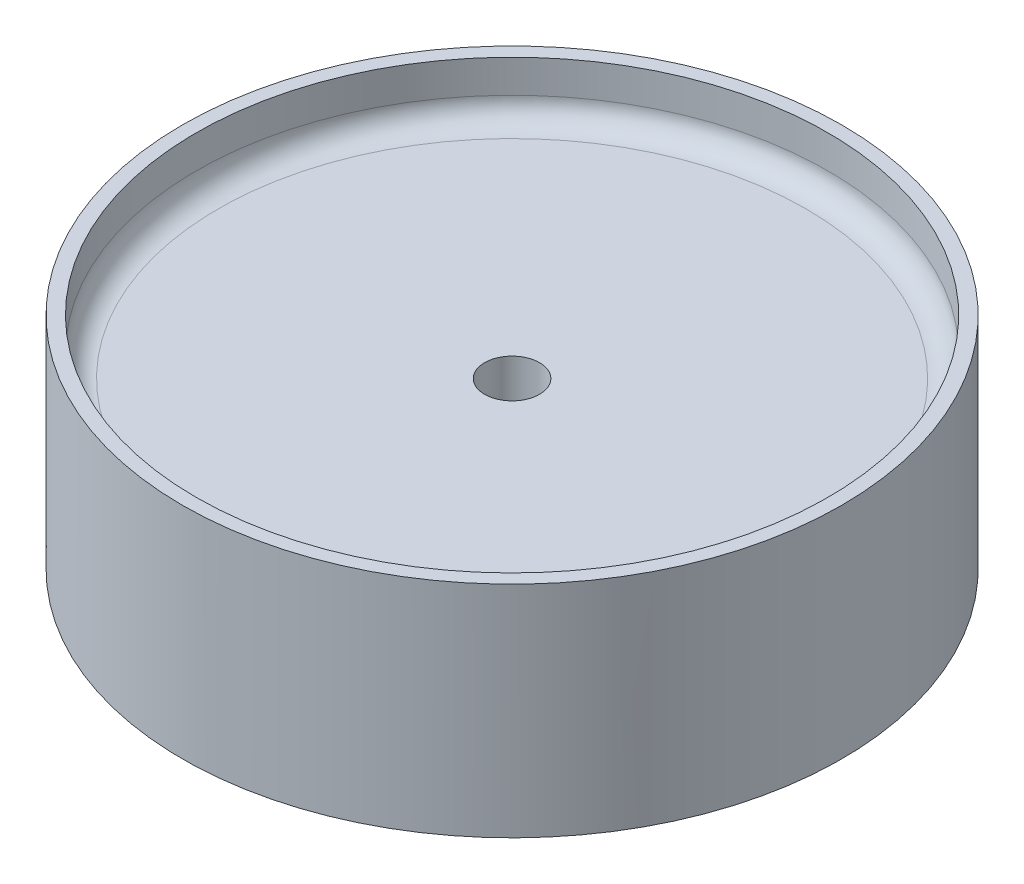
ISO-10303-21;
HEADER;
FILE_DESCRIPTION(('STEP AP214'),'2;1');
FILE_NAME('part.step','',(''),(''),'','','');
FILE_SCHEMA(('AUTOMOTIVE_DESIGN { 1 0 10303 214 1 1 1 1 }'));
ENDSEC;
DATA;
#1=APPLICATION_CONTEXT('core data for automotive mechanical design processes');
#2=APPLICATION_PROTOCOL_DEFINITION('international standard','automotive_design',2000,#1);
#3=PRODUCT_CONTEXT('',#1,'mechanical');
#4=PRODUCT('Part','Part','',(#3));
#5=PRODUCT_RELATED_PRODUCT_CATEGORY('part','',(#4));
#6=PRODUCT_DEFINITION_FORMATION('','',#4);
#7=PRODUCT_DEFINITION_CONTEXT('part definition',#1,'design');
#8=PRODUCT_DEFINITION('design','',#6,#7);
#9=PRODUCT_DEFINITION_SHAPE('','',#8);
#10=(LENGTH_UNIT() NAMED_UNIT(*) SI_UNIT(.MILLI.,.METRE.));
#11=(NAMED_UNIT(*) PLANE_ANGLE_UNIT() SI_UNIT($,.RADIAN.));
#12=(NAMED_UNIT(*) SI_UNIT($,.STERADIAN.) SOLID_ANGLE_UNIT());
#13=UNCERTAINTY_MEASURE_WITH_UNIT(LENGTH_MEASURE(1.E-05),#10,'distance_accuracy_value','');
#14=(GEOMETRIC_REPRESENTATION_CONTEXT(3) GLOBAL_UNCERTAINTY_ASSIGNED_CONTEXT((#13)) GLOBAL_UNIT_ASSIGNED_CONTEXT((#10,
#11,#12)) REPRESENTATION_CONTEXT('',''));
#15=CARTESIAN_POINT('',(0.,0.,0.));
#16=DIRECTION('',(0.,0.,1.));
#17=DIRECTION('',(1.,0.,0.));
#18=AXIS2_PLACEMENT_3D('',#15,#16,#17);
#19=CARTESIAN_POINT('',(0.,0.,0.));
#20=DIRECTION('',(0.,1.,0.));
#21=DIRECTION('',(0.,0.,1.));
#22=AXIS2_PLACEMENT_3D('',#19,#20,#21);
#23=PLANE('',#22);
#24=CARTESIAN_POINT('',(0.,0.,0.));
#25=DIRECTION('',(0.,1.,0.));
#26=DIRECTION('',(0.,0.,1.));
#27=AXIS2_PLACEMENT_3D('',#24,#25,#26);
#28=CIRCLE('',#27,33.9725);
#29=CARTESIAN_POINT('',(0.,0.,33.9725));
#30=VERTEX_POINT('',#29);
#31=EDGE_CURVE('E47',#30,#30,#28,.F.);
#32=ORIENTED_EDGE('',*,*,#31,.T.);
#33=EDGE_LOOP('',(#32));
#34=FACE_BOUND('',#33,.T.);
#35=CARTESIAN_POINT('',(0.,0.,0.));
#36=DIRECTION('',(0.,1.,0.));
#37=DIRECTION('',(0.,0.,1.));
#38=AXIS2_PLACEMENT_3D('',#35,#36,#37);
#39=CIRCLE('',#38,3.175);
#40=CARTESIAN_POINT('',(0.,0.,3.175));
#41=VERTEX_POINT('',#40);
#42=EDGE_CURVE('E53',#41,#41,#39,.T.);
#43=ORIENTED_EDGE('',*,*,#42,.T.);
#44=EDGE_LOOP('',(#43));
#45=FACE_BOUND('',#44,.T.);
#46=ADVANCED_FACE('F32',(#34,#45),#23,.F.);
#47=CARTESIAN_POINT('',(0.,12.7,0.));
#48=DIRECTION('',(0.,1.,0.));
#49=DIRECTION('',(0.,0.,1.));
#50=AXIS2_PLACEMENT_3D('',#47,#48,#49);
#51=PLANE('',#50);
#52=CARTESIAN_POINT('',(0.,12.7,0.));
#53=DIRECTION('',(0.,1.,0.));
#54=DIRECTION('',(0.,0.,1.));
#55=AXIS2_PLACEMENT_3D('',#52,#53,#54);
#56=CIRCLE('',#55,33.9725);
#57=CARTESIAN_POINT('',(0.,12.7,33.9725));
#58=VERTEX_POINT('',#57);
#59=EDGE_CURVE('E10',#58,#58,#56,.T.);
#60=ORIENTED_EDGE('',*,*,#59,.T.);
#61=EDGE_LOOP('',(#60));
#62=FACE_BOUND('',#61,.T.);
#63=CARTESIAN_POINT('',(0.,12.7,0.));
#64=DIRECTION('',(0.,1.,0.));
#65=DIRECTION('',(0.,0.,1.));
#66=AXIS2_PLACEMENT_3D('',#63,#64,#65);
#67=CIRCLE('',#66,3.175);
#68=CARTESIAN_POINT('',(0.,12.7,3.175));
#69=VERTEX_POINT('',#68);
#70=EDGE_CURVE('E52',#69,#69,#67,.T.);
#71=ORIENTED_EDGE('',*,*,#70,.F.);
#72=EDGE_LOOP('',(#71));
#73=FACE_BOUND('',#72,.T.);
#74=ADVANCED_FACE('F88',(#62,#73),#51,.T.);
#75=CARTESIAN_POINT('',(0.,12.7,0.));
#76=DIRECTION('',(0.,-1.,0.));
#77=DIRECTION('',(0.,0.,-1.));
#78=AXIS2_PLACEMENT_3D('',#75,#76,#77);
#79=CYLINDRICAL_SURFACE('',#78,38.1);
#80=CARTESIAN_POINT('',(0.,19.05,0.));
#81=DIRECTION('',(0.,1.,0.));
#82=DIRECTION('',(0.,0.,1.));
#83=AXIS2_PLACEMENT_3D('',#80,#81,#82);
#84=CIRCLE('',#83,38.1);
#85=CARTESIAN_POINT('',(0.,19.05,38.1));
#86=VERTEX_POINT('',#85);
#87=EDGE_CURVE('E56',#86,#86,#84,.T.);
#88=ORIENTED_EDGE('',*,*,#87,.F.);
#89=EDGE_LOOP('',(#88));
#90=FACE_BOUND('',#89,.T.);
#91=CARTESIAN_POINT('',(0.,-6.35,0.));
#92=DIRECTION('',(0.,-1.,0.));
#93=DIRECTION('',(0.,0.,-1.));
#94=AXIS2_PLACEMENT_3D('',#91,#92,#93);
#95=CIRCLE('',#94,38.1);
#96=CARTESIAN_POINT('',(0.,-6.35,-38.1));
#97=VERTEX_POINT('',#96);
#98=EDGE_CURVE('E64',#97,#97,#95,.T.);
#99=ORIENTED_EDGE('',*,*,#98,.F.);
#100=EDGE_LOOP('',(#99));
#101=FACE_BOUND('',#100,.T.);
#102=ADVANCED_FACE('F94',(#90,#101),#79,.T.);
#103=CARTESIAN_POINT('',(0.,12.7,0.));
#104=DIRECTION('',(0.,-1.,0.));
#105=DIRECTION('',(0.,0.,-1.));
#106=AXIS2_PLACEMENT_3D('',#103,#104,#105);
#107=CYLINDRICAL_SURFACE('',#106,3.175);
#108=ORIENTED_EDGE('',*,*,#70,.T.);
#109=EDGE_LOOP('',(#108));
#110=FACE_BOUND('',#109,.T.);
#111=ORIENTED_EDGE('',*,*,#42,.F.);
#112=EDGE_LOOP('',(#111));
#113=FACE_BOUND('',#112,.T.);
#114=ADVANCED_FACE('F100',(#110,#113),#107,.F.);
#115=CARTESIAN_POINT('',(0.,19.05,0.));
#116=DIRECTION('',(0.,1.,0.));
#117=DIRECTION('',(0.,0.,1.));
#118=AXIS2_PLACEMENT_3D('',#115,#116,#117);
#119=PLANE('',#118);
#120=ORIENTED_EDGE('',*,*,#87,.T.);
#121=EDGE_LOOP('',(#120));
#122=FACE_BOUND('',#121,.T.);
#123=CARTESIAN_POINT('',(0.,19.05,0.));
#124=DIRECTION('',(0.,1.,0.));
#125=DIRECTION('',(0.,0.,1.));
#126=AXIS2_PLACEMENT_3D('',#123,#124,#125);
#127=CIRCLE('',#126,36.5125);
#128=CARTESIAN_POINT('',(0.,19.05,36.5125));
#129=VERTEX_POINT('',#128);
#130=EDGE_CURVE('E61',#129,#129,#127,.T.);
#131=ORIENTED_EDGE('',*,*,#130,.F.);
#132=EDGE_LOOP('',(#131));
#133=FACE_BOUND('',#132,.T.);
#134=ADVANCED_FACE('F85',(#122,#133),#119,.T.);
#135=CARTESIAN_POINT('',(0.,19.05,0.));
#136=DIRECTION('',(0.,-1.,0.));
#137=DIRECTION('',(0.,0.,-1.));
#138=AXIS2_PLACEMENT_3D('',#135,#136,#137);
#139=CYLINDRICAL_SURFACE('',#138,36.5125);
#140=CARTESIAN_POINT('',(0.,15.24,0.));
#141=DIRECTION('',(0.,1.,0.));
#142=DIRECTION('',(0.,0.,1.));
#143=AXIS2_PLACEMENT_3D('',#140,#141,#142);
#144=CIRCLE('',#143,36.5125);
#145=CARTESIAN_POINT('',(0.,15.24,36.5125));
#146=VERTEX_POINT('',#145);
#147=EDGE_CURVE('E39',#146,#146,#144,.F.);
#148=ORIENTED_EDGE('',*,*,#147,.T.);
#149=EDGE_LOOP('',(#148));
#150=FACE_BOUND('',#149,.T.);
#151=ORIENTED_EDGE('',*,*,#130,.T.);
#152=EDGE_LOOP('',(#151));
#153=FACE_BOUND('',#152,.T.);
#154=ADVANCED_FACE('F75',(#150,#153),#139,.F.);
#155=CARTESIAN_POINT('',(0.,-6.35,0.));
#156=DIRECTION('',(0.,-1.,0.));
#157=DIRECTION('',(0.,0.,-1.));
#158=AXIS2_PLACEMENT_3D('',#155,#156,#157);
#159=PLANE('',#158);
#160=ORIENTED_EDGE('',*,*,#98,.T.);
#161=EDGE_LOOP('',(#160));
#162=FACE_BOUND('',#161,.T.);
#163=CARTESIAN_POINT('',(0.,-6.35,0.));
#164=DIRECTION('',(0.,-1.,0.));
#165=DIRECTION('',(0.,0.,-1.));
#166=AXIS2_PLACEMENT_3D('',#163,#164,#165);
#167=CIRCLE('',#166,36.5125);
#168=CARTESIAN_POINT('',(0.,-6.35,-36.5125));
#169=VERTEX_POINT('',#168);
#170=EDGE_CURVE('E67',#169,#169,#167,.T.);
#171=ORIENTED_EDGE('',*,*,#170,.F.);
#172=EDGE_LOOP('',(#171));
#173=FACE_BOUND('',#172,.T.);
#174=ADVANCED_FACE('F73',(#162,#173),#159,.T.);
#175=CARTESIAN_POINT('',(0.,-6.35,0.));
#176=DIRECTION('',(0.,1.,0.));
#177=DIRECTION('',(0.,0.,1.));
#178=AXIS2_PLACEMENT_3D('',#175,#176,#177);
#179=CYLINDRICAL_SURFACE('',#178,36.5125);
#180=CARTESIAN_POINT('',(0.,-2.54,0.));
#181=DIRECTION('',(0.,1.,0.));
#182=DIRECTION('',(0.,0.,1.));
#183=AXIS2_PLACEMENT_3D('',#180,#181,#182);
#184=CIRCLE('',#183,36.5125);
#185=CARTESIAN_POINT('',(0.,-2.54,36.5125));
#186=VERTEX_POINT('',#185);
#187=EDGE_CURVE('E43',#186,#186,#184,.T.);
#188=ORIENTED_EDGE('',*,*,#187,.T.);
#189=EDGE_LOOP('',(#188));
#190=FACE_BOUND('',#189,.T.);
#191=ORIENTED_EDGE('',*,*,#170,.T.);
#192=EDGE_LOOP('',(#191));
#193=FACE_BOUND('',#192,.T.);
#194=ADVANCED_FACE('F71',(#190,#193),#179,.F.);
#195=CARTESIAN_POINT('',(0.,-2.54,0.));
#196=DIRECTION('',(0.,1.,0.));
#197=DIRECTION('',(0.,0.,1.));
#198=AXIS2_PLACEMENT_3D('',#195,#196,#197);
#199=TOROIDAL_SURFACE('',#198,33.9725,2.54);
#200=ORIENTED_EDGE('',*,*,#187,.F.);
#201=EDGE_LOOP('',(#200));
#202=FACE_BOUND('',#201,.T.);
#203=ORIENTED_EDGE('',*,*,#31,.F.);
#204=EDGE_LOOP('',(#203));
#205=FACE_BOUND('',#204,.T.);
#206=ADVANCED_FACE('F82',(#202,#205),#199,.F.);
#207=CARTESIAN_POINT('',(0.,15.24,0.));
#208=DIRECTION('',(0.,1.,0.));
#209=DIRECTION('',(0.,0.,1.));
#210=AXIS2_PLACEMENT_3D('',#207,#208,#209);
#211=TOROIDAL_SURFACE('',#210,33.9725,2.54);
#212=ORIENTED_EDGE('',*,*,#59,.F.);
#213=EDGE_LOOP('',(#212));
#214=FACE_BOUND('',#213,.T.);
#215=ORIENTED_EDGE('',*,*,#147,.F.);
#216=EDGE_LOOP('',(#215));
#217=FACE_BOUND('',#216,.T.);
#218=ADVANCED_FACE('F34',(#214,#217),#211,.F.);
#219=CLOSED_SHELL('',(#46,#74,#102,#114,#134,#154,#174,#194,#206,#218));
#220=MANIFOLD_SOLID_BREP('B2',#219);
#221=ADVANCED_BREP_SHAPE_REPRESENTATION('',(#18,#220),#14);
#222=SHAPE_DEFINITION_REPRESENTATION(#9,#221);
ENDSEC;
END-ISO-10303-21;
